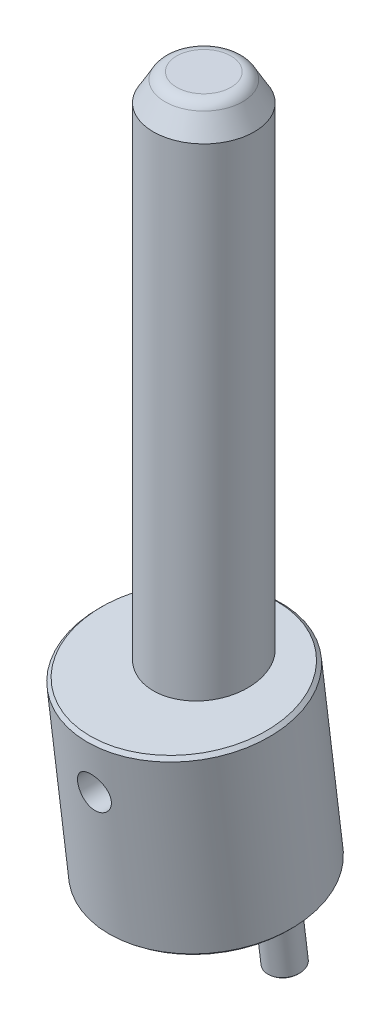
ISO-10303-21;
HEADER;
FILE_DESCRIPTION(('STEP AP214'),'2;1');
FILE_NAME('part.step','',(''),(''),'','','');
FILE_SCHEMA(('AUTOMOTIVE_DESIGN { 1 0 10303 214 1 1 1 1 }'));
ENDSEC;
DATA;
#1=APPLICATION_CONTEXT('core data for automotive mechanical design processes');
#2=APPLICATION_PROTOCOL_DEFINITION('international standard','automotive_design',2000,#1);
#3=PRODUCT_CONTEXT('',#1,'mechanical');
#4=PRODUCT('Part','Part','',(#3));
#5=PRODUCT_RELATED_PRODUCT_CATEGORY('part','',(#4));
#6=PRODUCT_DEFINITION_FORMATION('','',#4);
#7=PRODUCT_DEFINITION_CONTEXT('part definition',#1,'design');
#8=PRODUCT_DEFINITION('design','',#6,#7);
#9=PRODUCT_DEFINITION_SHAPE('','',#8);
#10=(LENGTH_UNIT() NAMED_UNIT(*) SI_UNIT(.MILLI.,.METRE.));
#11=(NAMED_UNIT(*) PLANE_ANGLE_UNIT() SI_UNIT($,.RADIAN.));
#12=(NAMED_UNIT(*) SI_UNIT($,.STERADIAN.) SOLID_ANGLE_UNIT());
#13=UNCERTAINTY_MEASURE_WITH_UNIT(LENGTH_MEASURE(1.E-05),#10,'distance_accuracy_value','');
#14=(GEOMETRIC_REPRESENTATION_CONTEXT(3) GLOBAL_UNCERTAINTY_ASSIGNED_CONTEXT((#13)) GLOBAL_UNIT_ASSIGNED_CONTEXT((#10,
#11,#12)) REPRESENTATION_CONTEXT('',''));
#15=CARTESIAN_POINT('',(0.,0.,0.));
#16=DIRECTION('',(0.,0.,1.));
#17=DIRECTION('',(1.,0.,0.));
#18=AXIS2_PLACEMENT_3D('',#15,#16,#17);
#19=CARTESIAN_POINT('',(0.,-25.2094466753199,-2.57557712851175));
#20=DIRECTION('',(0.,-0.992546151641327,-0.121869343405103));
#21=DIRECTION('',(0.,0.121869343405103,-0.992546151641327));
#22=AXIS2_PLACEMENT_3D('',#19,#20,#21);
#23=PLANE('',#22);
#24=CARTESIAN_POINT('',(-21.5,-25.2094466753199,-2.57557712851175));
#25=DIRECTION('',(0.,-0.992546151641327,-0.121869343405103));
#26=DIRECTION('',(0.,0.121869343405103,-0.992546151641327));
#27=AXIS2_PLACEMENT_3D('',#24,#25,#26);
#28=CIRCLE('',#27,4.50000075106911);
#29=CARTESIAN_POINT('',(-21.5,-24.6610345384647,-7.04203555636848));
#30=VERTEX_POINT('',#29);
#31=EDGE_CURVE('P0_E17',#30,#30,#28,.F.);
#32=ORIENTED_EDGE('',*,*,#31,.F.);
#33=EDGE_LOOP('',(#32));
#34=FACE_BOUND('',#33,.T.);
#35=ADVANCED_FACE('P0_F14',(#34),#23,.T.);
#36=CARTESIAN_POINT('',(0.,-25.2094466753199,-2.57557712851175));
#37=DIRECTION('',(0.,-0.992546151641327,-0.121869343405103));
#38=DIRECTION('',(0.,0.121869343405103,-0.992546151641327));
#39=AXIS2_PLACEMENT_3D('',#36,#37,#38);
#40=PLANE('',#39);
#41=CARTESIAN_POINT('',(21.5,-25.2094466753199,-2.57557712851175));
#42=DIRECTION('',(0.,-0.992546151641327,-0.121869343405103));
#43=DIRECTION('',(0.,0.121869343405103,-0.992546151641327));
#44=AXIS2_PLACEMENT_3D('',#41,#42,#43);
#45=CIRCLE('',#44,4.50000075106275);
#46=CARTESIAN_POINT('',(21.5,-24.6610345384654,-7.04203555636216));
#47=VERTEX_POINT('',#46);
#48=EDGE_CURVE('P0_E121',#47,#47,#45,.F.);
#49=ORIENTED_EDGE('',*,*,#48,.F.);
#50=EDGE_LOOP('',(#49));
#51=FACE_BOUND('',#50,.T.);
#52=ADVANCED_FACE('P0_F111',(#51),#40,.T.);
#53=CARTESIAN_POINT('',(0.,3.12944115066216E-12,-5.7744607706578E-13));
#54=DIRECTION('',(0.,-1.,0.));
#55=DIRECTION('',(0.,0.,-1.));
#56=AXIS2_PLACEMENT_3D('',#53,#54,#55);
#57=PLANE('',#56);
#58=CARTESIAN_POINT('',(0.,2.90045765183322E-12,-2.69847078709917E-12));
#59=DIRECTION('',(0.,-1.,0.));
#60=DIRECTION('',(0.,0.,-1.));
#61=AXIS2_PLACEMENT_3D('',#58,#59,#60);
#62=CIRCLE('',#61,15.);
#63=CARTESIAN_POINT('',(0.,2.90045765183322E-12,-15.0000000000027));
#64=VERTEX_POINT('',#63);
#65=EDGE_CURVE('P0_E36',#64,#64,#62,.F.);
#66=ORIENTED_EDGE('',*,*,#65,.T.);
#67=EDGE_LOOP('',(#66));
#68=FACE_BOUND('',#67,.T.);
#69=ADVANCED_FACE('P0_F108',(#68),#57,.F.);
#70=CARTESIAN_POINT('',(-21.5,-24.7131730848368,-2.51464239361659));
#71=DIRECTION('',(0.,0.992546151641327,0.121869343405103));
#72=DIRECTION('',(0.,-0.121869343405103,0.992546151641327));
#73=AXIS2_PLACEMENT_3D('',#70,#71,#72);
#74=CONICAL_SURFACE('',#73,5.00000135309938,0.785398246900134);
#75=CARTESIAN_POINT('',(-21.5,-24.7131717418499,-2.51464222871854));
#76=DIRECTION('',(0.,-0.992546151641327,-0.121869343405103));
#77=DIRECTION('',(0.,0.121869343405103,-0.992546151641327));
#78=AXIS2_PLACEMENT_3D('',#75,#76,#77);
#79=CIRCLE('',#78,5.);
#80=CARTESIAN_POINT('',(-21.5,-24.1038250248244,-7.47737298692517));
#81=VERTEX_POINT('',#80);
#82=EDGE_CURVE('P0_E33',#81,#81,#79,.F.);
#83=ORIENTED_EDGE('',*,*,#82,.F.);
#84=EDGE_LOOP('',(#83));
#85=FACE_BOUND('',#84,.T.);
#86=ORIENTED_EDGE('',*,*,#31,.T.);
#87=EDGE_LOOP('',(#86));
#88=FACE_BOUND('',#87,.T.);
#89=ADVANCED_FACE('P0_F104',(#85,#88),#74,.T.);
#90=CARTESIAN_POINT('',(21.5,-24.7131730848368,-2.51464239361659));
#91=DIRECTION('',(0.,0.992546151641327,0.121869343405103));
#92=DIRECTION('',(0.,-0.121869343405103,0.992546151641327));
#93=AXIS2_PLACEMENT_3D('',#90,#91,#92);
#94=CONICAL_SURFACE('',#93,5.00000135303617,0.785398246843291);
#95=CARTESIAN_POINT('',(21.5,-24.7131717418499,-2.51464222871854));
#96=DIRECTION('',(0.,-0.992546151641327,-0.121869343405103));
#97=DIRECTION('',(0.,0.121869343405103,-0.992546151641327));
#98=AXIS2_PLACEMENT_3D('',#95,#96,#97);
#99=CIRCLE('',#98,5.);
#100=CARTESIAN_POINT('',(21.5,-24.1038250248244,-7.47737298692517));
#101=VERTEX_POINT('',#100);
#102=EDGE_CURVE('P0_E29',#101,#101,#99,.F.);
#103=ORIENTED_EDGE('',*,*,#102,.F.);
#104=EDGE_LOOP('',(#103));
#105=FACE_BOUND('',#104,.T.);
#106=ORIENTED_EDGE('',*,*,#48,.T.);
#107=EDGE_LOOP('',(#106));
#108=FACE_BOUND('',#107,.T.);
#109=ADVANCED_FACE('P0_F99',(#105,#108),#94,.T.);
#110=CARTESIAN_POINT('',(0.,59.7458556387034,-2.69868762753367E-12));
#111=DIRECTION('',(0.,-1.,0.));
#112=DIRECTION('',(0.,0.,-1.));
#113=AXIS2_PLACEMENT_3D('',#110,#111,#112);
#114=CYLINDRICAL_SURFACE('',#113,15.);
#115=CARTESIAN_POINT('',(0.,45.0000000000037,-2.69955498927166E-12));
#116=DIRECTION('',(0.,0.992546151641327,0.121869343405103));
#117=DIRECTION('',(0.,-0.121869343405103,0.992546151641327));
#118=AXIS2_PLACEMENT_3D('',#115,#116,#117);
#119=ELLIPSE('',#118,15.1126473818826,15.);
#120=CARTESIAN_POINT('',(0.,43.1582315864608,14.9999999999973));
#121=VERTEX_POINT('',#120);
#122=EDGE_CURVE('P0_E32',#121,#121,#119,.F.);
#123=ORIENTED_EDGE('',*,*,#122,.F.);
#124=EDGE_LOOP('',(#123));
#125=FACE_BOUND('',#124,.T.);
#126=ORIENTED_EDGE('',*,*,#65,.F.);
#127=EDGE_LOOP('',(#126));
#128=FACE_BOUND('',#127,.T.);
#129=CARTESIAN_POINT('',(0.,31.0000000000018,14.9999999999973));
#130=CARTESIAN_POINT('',(-0.13627460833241,30.9999999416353,14.9999999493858));
#131=CARTESIAN_POINT('',(-0.27255067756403,30.9944241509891,14.9981386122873));
#132=CARTESIAN_POINT('',(-0.544142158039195,30.9721706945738,14.9907428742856));
#133=CARTESIAN_POINT('',(-0.679457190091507,30.9554888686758,14.9852070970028));
#134=CARTESIAN_POINT('',(-0.948257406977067,30.9111491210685,14.9706027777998));
#135=CARTESIAN_POINT('',(-1.08174007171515,30.8834773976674,14.9615297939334));
#136=CARTESIAN_POINT('',(-1.34580155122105,30.8174009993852,14.94009293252));
#137=CARTESIAN_POINT('',(-1.47637921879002,30.7789921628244,14.9277277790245));
#138=CARTESIAN_POINT('',(-1.7333461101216,30.6918928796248,14.9000723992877));
#139=CARTESIAN_POINT('',(-1.85974572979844,30.6432305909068,14.8847901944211));
#140=CARTESIAN_POINT('',(-2.10792399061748,30.5359631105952,14.8516789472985));
#141=CARTESIAN_POINT('',(-2.22970089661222,30.4773542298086,14.8338489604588));
#142=CARTESIAN_POINT('',(-2.58680471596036,30.2873070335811,14.7772227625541));
#143=CARTESIAN_POINT('',(-2.81420620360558,30.1415453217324,14.7352562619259));
#144=CARTESIAN_POINT('',(-3.24874257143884,29.8108587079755,14.6457020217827));
#145=CARTESIAN_POINT('',(-3.45501840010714,29.6248491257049,14.5979792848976));
#146=CARTESIAN_POINT('',(-3.8341436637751,29.2211801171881,14.5030192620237));
#147=CARTESIAN_POINT('',(-4.0069839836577,29.0035120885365,14.4557821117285));
#148=CARTESIAN_POINT('',(-4.31912807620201,28.5350726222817,14.3656662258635));
#149=CARTESIAN_POINT('',(-4.45732572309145,28.2835298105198,14.3229516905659));
#150=CARTESIAN_POINT('',(-4.68909399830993,27.7591186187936,14.248765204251));
#151=CARTESIAN_POINT('',(-4.78267844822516,27.4862568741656,14.2172897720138));
#152=CARTESIAN_POINT('',(-4.91936749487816,26.9366338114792,14.1705651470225));
#153=CARTESIAN_POINT('',(-4.96406724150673,26.6603139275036,14.1548047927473));
#154=CARTESIAN_POINT('',(-5.00670561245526,26.1036813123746,14.1397828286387));
#155=CARTESIAN_POINT('',(-5.00465868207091,25.8233698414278,14.1405161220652));
#156=CARTESIAN_POINT('',(-4.95509941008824,25.280317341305,14.1579507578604));
#157=CARTESIAN_POINT('',(-4.90966912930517,25.0173587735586,14.1739208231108));
#158=CARTESIAN_POINT('',(-4.77803186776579,24.5030345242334,14.2188326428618));
#159=CARTESIAN_POINT('',(-4.69181981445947,24.2516702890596,14.2477760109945));
#160=CARTESIAN_POINT('',(-4.47968995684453,23.7629279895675,14.3158968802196));
#161=CARTESIAN_POINT('',(-4.3531541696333,23.5258408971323,14.3552319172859));
#162=CARTESIAN_POINT('',(-4.06444611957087,23.0756402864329,14.4396288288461));
#163=CARTESIAN_POINT('',(-3.90226546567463,22.8625324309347,14.4846920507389));
#164=CARTESIAN_POINT('',(-3.53674216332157,22.4545530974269,14.5783642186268));
#165=CARTESIAN_POINT('',(-3.33169626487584,22.2612084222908,14.627035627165));
#166=CARTESIAN_POINT('',(-3.00176707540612,21.9988448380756,14.6970107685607));
#167=CARTESIAN_POINT('',(-2.88796886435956,21.9159467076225,14.7198467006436));
#168=CARTESIAN_POINT('',(-2.65358317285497,21.7599196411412,14.7638979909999));
#169=CARTESIAN_POINT('',(-2.53299841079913,21.6867868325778,14.7851139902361));
#170=CARTESIAN_POINT('',(-2.28442944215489,21.5500863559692,14.8255663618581));
#171=CARTESIAN_POINT('',(-2.15637801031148,21.4866337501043,14.8447781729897));
#172=CARTESIAN_POINT('',(-1.89503347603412,21.3708247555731,14.8803974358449));
#173=CARTESIAN_POINT('',(-1.76174256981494,21.3184637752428,14.8968060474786));
#174=CARTESIAN_POINT('',(-1.49104566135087,21.2253547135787,14.9263287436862));
#175=CARTESIAN_POINT('',(-1.3536464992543,21.1845884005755,14.939447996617));
#176=CARTESIAN_POINT('',(-1.0756272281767,21.1149668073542,14.9620340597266));
#177=CARTESIAN_POINT('',(-0.93500858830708,21.0861062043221,14.9715025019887));
#178=CARTESIAN_POINT('',(-0.662330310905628,21.0422867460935,14.9859443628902));
#179=CARTESIAN_POINT('',(-0.530427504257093,21.0264417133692,14.9912035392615));
#180=CARTESIAN_POINT('',(-0.265683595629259,21.0052983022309,14.9982313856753));
#181=CARTESIAN_POINT('',(-0.132842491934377,20.9999999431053,15.0000000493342));
#182=CARTESIAN_POINT('',(0.136274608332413,21.0000000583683,14.9999999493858));
#183=CARTESIAN_POINT('',(0.272550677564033,21.0055758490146,14.9981386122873));
#184=CARTESIAN_POINT('',(0.544142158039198,21.0278293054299,14.9907428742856));
#185=CARTESIAN_POINT('',(0.67945719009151,21.0445111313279,14.9852070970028));
#186=CARTESIAN_POINT('',(0.94825740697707,21.0888508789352,14.9706027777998));
#187=CARTESIAN_POINT('',(1.08174007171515,21.1165226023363,14.9615297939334));
#188=CARTESIAN_POINT('',(1.34580155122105,21.1825990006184,14.94009293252));
#189=CARTESIAN_POINT('',(1.47637921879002,21.2210078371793,14.9277277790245));
#190=CARTESIAN_POINT('',(1.7333461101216,21.3081071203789,14.9000723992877));
#191=CARTESIAN_POINT('',(1.85974572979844,21.3567694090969,14.8847901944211));
#192=CARTESIAN_POINT('',(2.10792399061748,21.4640368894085,14.8516789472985));
#193=CARTESIAN_POINT('',(2.22970089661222,21.5226457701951,14.8338489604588));
#194=CARTESIAN_POINT('',(2.58680471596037,21.7126929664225,14.7772227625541));
#195=CARTESIAN_POINT('',(2.81420620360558,21.8584546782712,14.7352562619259));
#196=CARTESIAN_POINT('',(3.24874257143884,22.1891412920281,14.6457020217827));
#197=CARTESIAN_POINT('',(3.45501840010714,22.3751508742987,14.5979792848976));
#198=CARTESIAN_POINT('',(3.8341436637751,22.7788198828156,14.5030192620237));
#199=CARTESIAN_POINT('',(4.0069839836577,22.9964879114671,14.4557821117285));
#200=CARTESIAN_POINT('',(4.31912807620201,23.464927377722,14.3656662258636));
#201=CARTESIAN_POINT('',(4.45732572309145,23.7164701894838,14.3229516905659));
#202=CARTESIAN_POINT('',(4.68909399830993,24.24088138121,14.248765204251));
#203=CARTESIAN_POINT('',(4.78267844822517,24.5137431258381,14.2172897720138));
#204=CARTESIAN_POINT('',(4.91936749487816,25.0633661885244,14.1705651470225));
#205=CARTESIAN_POINT('',(4.96406724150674,25.3396860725,14.1548047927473));
#206=CARTESIAN_POINT('',(5.00670561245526,25.896318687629,14.1397828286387));
#207=CARTESIAN_POINT('',(5.00465868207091,26.1766301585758,14.1405161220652));
#208=CARTESIAN_POINT('',(4.95509941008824,26.7196826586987,14.1579507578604));
#209=CARTESIAN_POINT('',(4.90966912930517,26.982641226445,14.1739208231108));
#210=CARTESIAN_POINT('',(4.77803186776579,27.4969654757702,14.2188326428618));
#211=CARTESIAN_POINT('',(4.69181981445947,27.748329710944,14.2477760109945));
#212=CARTESIAN_POINT('',(4.47968995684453,28.2370720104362,14.3158968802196));
#213=CARTESIAN_POINT('',(4.35315416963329,28.4741591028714,14.3552319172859));
#214=CARTESIAN_POINT('',(4.06444611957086,28.9243597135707,14.4396288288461));
#215=CARTESIAN_POINT('',(3.90226546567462,29.1374675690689,14.4846920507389));
#216=CARTESIAN_POINT('',(3.53674216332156,29.5454469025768,14.5783642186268));
#217=CARTESIAN_POINT('',(3.33169626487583,29.7387915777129,14.627035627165));
#218=CARTESIAN_POINT('',(3.00176707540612,30.0011551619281,14.6970107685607));
#219=CARTESIAN_POINT('',(2.88796886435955,30.0840532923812,14.7198467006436));
#220=CARTESIAN_POINT('',(2.65358317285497,30.2400803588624,14.7638979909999));
#221=CARTESIAN_POINT('',(2.53299841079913,30.3132131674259,14.7851139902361));
#222=CARTESIAN_POINT('',(2.28442944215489,30.4499136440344,14.8255663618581));
#223=CARTESIAN_POINT('',(2.15637801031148,30.5133662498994,14.8447781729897));
#224=CARTESIAN_POINT('',(1.89503347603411,30.6291752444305,14.8803974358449));
#225=CARTESIAN_POINT('',(1.76174256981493,30.6815362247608,14.8968060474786));
#226=CARTESIAN_POINT('',(1.49104566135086,30.7746452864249,14.9263287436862));
#227=CARTESIAN_POINT('',(1.3536464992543,30.8154115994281,14.939447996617));
#228=CARTESIAN_POINT('',(1.0756272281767,30.8850331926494,14.9620340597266));
#229=CARTESIAN_POINT('',(0.935008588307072,30.9138937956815,14.9715025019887));
#230=CARTESIAN_POINT('',(0.662330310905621,30.9577132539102,14.9859443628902));
#231=CARTESIAN_POINT('',(0.530427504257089,30.9735582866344,14.9912035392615));
#232=CARTESIAN_POINT('',(0.265683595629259,30.9947016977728,14.9982313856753));
#233=CARTESIAN_POINT('',(0.132842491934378,31.0000000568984,15.0000000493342));
#234=CARTESIAN_POINT('',(0.,31.0000000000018,14.9999999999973));
#235=B_SPLINE_CURVE_WITH_KNOTS('',3,(#129,#130,#131,#132,#133,#134,#135,#136,#137,#138,#139,
#140,#141,#142,#143,#144,#145,#146,#147,#148,#149,#150,#151,#152,#153,#154,#155,#156,#157,#158,
#159,#160,#161,#162,#163,#164,#165,#166,#167,#168,#169,#170,#171,#172,#173,#174,#175,#176,#177,
#178,#179,#180,#181,#182,#183,#184,#185,#186,#187,#188,#189,#190,#191,#192,#193,#194,#195,#196,
#197,#198,#199,#200,#201,#202,#203,#204,#205,#206,#207,#208,#209,#210,#211,#212,#213,#214,#215,
#216,#217,#218,#219,#220,#221,#222,#223,#224,#225,#226,#227,#228,#229,#230,#231,#232,#233,#234),
.UNSPECIFIED.,.T.,.F.,(4,2,2,2,2,2,2,2,2,2,2,2,2,2,2,2,2,2,2,2,2,2,2,2,2,2,2,2,2,2,2,2,2,2,2,2,
2,2,2,2,2,2,2,2,2,2,2,2,2,2,2,2,4),(0.,0.408700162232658,0.817553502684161,1.22692193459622,
1.6364492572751,2.04486626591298,2.45343508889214,3.26962321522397,4.11140352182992,
4.9534129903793,5.81961254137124,6.68554356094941,7.52228757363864,8.35877302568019,
9.15703078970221,9.95538786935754,10.7666215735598,11.5780464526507,12.4317109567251,
12.8591940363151,13.286507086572,13.7185586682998,14.150431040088,14.5816205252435,
15.0126170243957,15.4110232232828,15.8094301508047,16.2181303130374,16.6269836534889,
17.0363520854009,17.4458794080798,17.8542964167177,18.2628652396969,19.0790533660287,
19.9208336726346,20.762843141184,21.629042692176,22.4949737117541,23.3317177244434,
24.1682031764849,24.9664609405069,25.7648180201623,26.5760517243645,27.3874766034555,
28.2411411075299,28.6686241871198,29.0959372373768,29.5279888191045,29.9598611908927,
30.3910506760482,30.8220471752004,31.2204533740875,31.6188603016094),.UNSPECIFIED.);
#236=CARTESIAN_POINT('',(0.,31.0000000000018,14.9999999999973));
#237=VERTEX_POINT('',#236);
#238=EDGE_CURVE('P0_E84',#237,#237,#235,.T.);
#239=ORIENTED_EDGE('',*,*,#238,.T.);
#240=EDGE_LOOP('',(#239));
#241=FACE_BOUND('',#240,.T.);
#242=ADVANCED_FACE('P0_F93',(#125,#128,#241),#114,.F.);
#243=CARTESIAN_POINT('',(-21.5,-10.3212544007,-0.7475369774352));
#244=DIRECTION('',(0.,-0.992546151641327,-0.121869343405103));
#245=DIRECTION('',(0.,0.121869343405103,-0.992546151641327));
#246=AXIS2_PLACEMENT_3D('',#243,#244,#245);
#247=CYLINDRICAL_SURFACE('',#246,5.);
#248=CARTESIAN_POINT('',(-21.5,-10.3212544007,-0.7475369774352));
#249=DIRECTION('',(0.,-0.992546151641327,-0.121869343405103));
#250=DIRECTION('',(0.,0.121869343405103,-0.992546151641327));
#251=AXIS2_PLACEMENT_3D('',#248,#249,#250);
#252=CIRCLE('',#251,5.);
#253=CARTESIAN_POINT('',(-21.5,-9.71190768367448,-5.71026773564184));
#254=VERTEX_POINT('',#253);
#255=EDGE_CURVE('P0_E80',#254,#254,#252,.T.);
#256=ORIENTED_EDGE('',*,*,#255,.T.);
#257=EDGE_LOOP('',(#256));
#258=FACE_BOUND('',#257,.T.);
#259=ORIENTED_EDGE('',*,*,#82,.T.);
#260=EDGE_LOOP('',(#259));
#261=FACE_BOUND('',#260,.T.);
#262=ADVANCED_FACE('P0_F98',(#258,#261),#247,.T.);
#263=CARTESIAN_POINT('',(21.5,-10.3212544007,-0.7475369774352));
#264=DIRECTION('',(0.,-0.992546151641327,-0.121869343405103));
#265=DIRECTION('',(0.,0.121869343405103,-0.992546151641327));
#266=AXIS2_PLACEMENT_3D('',#263,#264,#265);
#267=CYLINDRICAL_SURFACE('',#266,5.);
#268=CARTESIAN_POINT('',(21.5,-10.3212544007,-0.7475369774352));
#269=DIRECTION('',(0.,-0.992546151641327,-0.121869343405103));
#270=DIRECTION('',(0.,0.121869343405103,-0.992546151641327));
#271=AXIS2_PLACEMENT_3D('',#268,#269,#270);
#272=CIRCLE('',#271,5.);
#273=CARTESIAN_POINT('',(21.5,-9.71190768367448,-5.71026773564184));
#274=VERTEX_POINT('',#273);
#275=EDGE_CURVE('P0_E76',#274,#274,#272,.T.);
#276=ORIENTED_EDGE('',*,*,#275,.T.);
#277=EDGE_LOOP('',(#276));
#278=FACE_BOUND('',#277,.T.);
#279=ORIENTED_EDGE('',*,*,#102,.T.);
#280=EDGE_LOOP('',(#279));
#281=FACE_BOUND('',#280,.T.);
#282=ADVANCED_FACE('P0_F178',(#278,#281),#267,.T.);
#283=CARTESIAN_POINT('',(0.,44.268783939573,5.95527690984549));
#284=DIRECTION('',(0.,0.992546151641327,0.121869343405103));
#285=DIRECTION('',(0.,-0.121869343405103,0.992546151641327));
#286=AXIS2_PLACEMENT_3D('',#283,#284,#285);
#287=PLANE('',#286);
#288=ORIENTED_EDGE('',*,*,#122,.T.);
#289=EDGE_LOOP('',(#288));
#290=FACE_BOUND('',#289,.T.);
#291=CARTESIAN_POINT('',(0.,44.268783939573,5.95527690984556));
#292=DIRECTION('',(0.,0.992546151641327,0.121869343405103));
#293=DIRECTION('',(0.,-0.121869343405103,0.992546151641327));
#294=AXIS2_PLACEMENT_3D('',#291,#292,#293);
#295=CIRCLE('',#294,27.9999945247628);
#296=CARTESIAN_POINT('',(0.,40.8564429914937,33.7465637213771));
#297=VERTEX_POINT('',#296);
#298=EDGE_CURVE('P0_E46',#297,#297,#295,.F.);
#299=ORIENTED_EDGE('',*,*,#298,.F.);
#300=EDGE_LOOP('',(#299));
#301=FACE_BOUND('',#300,.T.);
#302=ADVANCED_FACE('P0_F71',(#290,#301),#287,.T.);
#303=CARTESIAN_POINT('',(0.,26.0000000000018,-4.49837953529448));
#304=DIRECTION('',(0.,0.,1.));
#305=DIRECTION('',(0.,-1.,0.));
#306=AXIS2_PLACEMENT_3D('',#303,#304,#305);
#307=CYLINDRICAL_SURFACE('',#306,5.);
#308=ORIENTED_EDGE('',*,*,#238,.F.);
#309=EDGE_LOOP('',(#308));
#310=FACE_BOUND('',#309,.T.);
#311=CARTESIAN_POINT('',(0.,21.0000000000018,32.3160144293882));
#312=CARTESIAN_POINT('',(-0.1403461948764,21.0000006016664,32.3160142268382));
#313=CARTESIAN_POINT('',(-0.280708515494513,21.0059135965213,32.3157114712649));
#314=CARTESIAN_POINT('',(-0.560489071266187,21.0295298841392,32.3145230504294));
#315=CARTESIAN_POINT('',(-0.699906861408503,21.0472383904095,32.3136371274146));
#316=CARTESIAN_POINT('',(-0.976970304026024,21.094359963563,32.3113500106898));
#317=CARTESIAN_POINT('',(-1.11461288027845,21.1237911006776,32.3099480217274));
#318=CARTESIAN_POINT('',(-1.38697401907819,21.1941604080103,32.3067422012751));
#319=CARTESIAN_POINT('',(-1.52169146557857,21.2351028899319,32.3049382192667));
#320=CARTESIAN_POINT('',(-1.78703419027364,21.3281426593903,32.3010858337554));
#321=CARTESIAN_POINT('',(-1.91766413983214,21.3802266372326,32.2990377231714));
#322=CARTESIAN_POINT('',(-2.17412119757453,21.4952299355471,32.2948846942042));
#323=CARTESIAN_POINT('',(-2.29994651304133,21.5581532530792,32.2927797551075));
#324=CARTESIAN_POINT('',(-2.54575621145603,21.6943233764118,32.2887356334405));
#325=CARTESIAN_POINT('',(-2.66574505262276,21.7675621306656,32.2867963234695));
#326=CARTESIAN_POINT('',(-2.89917970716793,21.9239113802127,32.2833237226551));
#327=CARTESIAN_POINT('',(-3.01262309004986,22.0070255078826,32.2817905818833));
#328=CARTESIAN_POINT('',(-3.23214672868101,22.1825423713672,32.2793890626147));
#329=CARTESIAN_POINT('',(-3.33822469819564,22.2749479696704,32.2785208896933));
#330=CARTESIAN_POINT('',(-3.5422598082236,22.4684045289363,32.2777149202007));
#331=CARTESIAN_POINT('',(-3.64021392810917,22.5694586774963,32.2777774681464));
#332=CARTESIAN_POINT('',(-3.82722424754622,22.7794235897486,32.2790961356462));
#333=CARTESIAN_POINT('',(-3.91628336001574,22.8883317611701,32.2803518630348));
#334=CARTESIAN_POINT('',(-4.08493121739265,23.1132880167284,32.2843069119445));
#335=CARTESIAN_POINT('',(-4.16451648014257,23.2293387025,32.2870067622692));
#336=CARTESIAN_POINT('',(-4.31322552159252,23.4670878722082,32.2940602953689));
#337=CARTESIAN_POINT('',(-4.38240064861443,23.5887544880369,32.2984054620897));
#338=CARTESIAN_POINT('',(-4.51030821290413,23.8374364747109,32.3089450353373));
#339=CARTESIAN_POINT('',(-4.56903679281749,23.9644537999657,32.315140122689));
#340=CARTESIAN_POINT('',(-4.67558894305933,24.2228181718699,32.3295311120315));
#341=CARTESIAN_POINT('',(-4.72341729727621,24.3541632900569,32.337726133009));
#342=CARTESIAN_POINT('',(-4.80789683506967,24.6202704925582,32.3562192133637));
#343=CARTESIAN_POINT('',(-4.84454391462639,24.7550338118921,32.3665180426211));
#344=CARTESIAN_POINT('',(-4.93688227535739,25.1611177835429,32.4005185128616));
#345=CARTESIAN_POINT('',(-4.9757781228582,25.4362013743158,32.4274299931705));
#346=CARTESIAN_POINT('',(-5.00762672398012,25.9879273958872,32.4895650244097));
#347=CARTESIAN_POINT('',(-5.00057783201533,26.2645698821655,32.5247888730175));
#348=CARTESIAN_POINT('',(-4.94109053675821,26.81396350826,32.6026732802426));
#349=CARTESIAN_POINT('',(-4.88831502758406,27.086670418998,32.6453871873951));
#350=CARTESIAN_POINT('',(-4.7387120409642,27.6189440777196,32.7361104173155));
#351=CARTESIAN_POINT('',(-4.64187793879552,27.8785088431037,32.7841205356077));
#352=CARTESIAN_POINT('',(-4.46456377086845,28.2555797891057,32.8586334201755));
#353=CARTESIAN_POINT('',(-4.39916939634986,28.3805882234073,32.8841965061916));
#354=CARTESIAN_POINT('',(-4.25809696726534,28.6245830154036,32.9356111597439));
#355=CARTESIAN_POINT('',(-4.18242246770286,28.7435714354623,32.9614626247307));
#356=CARTESIAN_POINT('',(-4.02125558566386,28.9747907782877,33.0130529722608));
#357=CARTESIAN_POINT('',(-3.93575922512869,29.0870189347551,33.0387918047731));
#358=CARTESIAN_POINT('',(-3.75555564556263,29.3038867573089,33.0897102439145));
#359=CARTESIAN_POINT('',(-3.66085184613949,29.4085292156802,33.1148900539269));
#360=CARTESIAN_POINT('',(-3.46147534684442,29.6109051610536,33.1645984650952));
#361=CARTESIAN_POINT('',(-3.35668562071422,29.708526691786,33.1891137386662));
#362=CARTESIAN_POINT('',(-3.13896542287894,29.8945330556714,33.2366741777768));
#363=CARTESIAN_POINT('',(-3.02603811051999,29.98292144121,33.2597199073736));
#364=CARTESIAN_POINT('',(-2.79266578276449,30.149893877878,33.3039297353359));
#365=CARTESIAN_POINT('',(-2.672214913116,30.2284701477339,33.3250923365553));
#366=CARTESIAN_POINT('',(-2.42475245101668,30.3750711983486,33.3650874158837));
#367=CARTESIAN_POINT('',(-2.29774365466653,30.4431004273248,33.3839208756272));
#368=CARTESIAN_POINT('',(-2.04039417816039,30.5669254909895,33.4185615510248));
#369=CARTESIAN_POINT('',(-1.91015664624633,30.6229219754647,33.4344177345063));
#370=CARTESIAN_POINT('',(-1.6451638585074,30.7237189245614,33.4631901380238));
#371=CARTESIAN_POINT('',(-1.51041056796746,30.7685241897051,33.4761076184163));
#372=CARTESIAN_POINT('',(-1.23759367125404,30.8464886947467,33.4987168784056));
#373=CARTESIAN_POINT('',(-1.09953687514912,30.8796700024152,33.5084147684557));
#374=CARTESIAN_POINT('',(-0.82096944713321,30.9341801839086,33.5244053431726));
#375=CARTESIAN_POINT('',(-0.680460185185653,30.9555154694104,33.5306998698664));
#376=CARTESIAN_POINT('',(-0.449764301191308,30.9805445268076,33.5380965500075));
#377=CARTESIAN_POINT('',(-0.359985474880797,30.9878372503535,33.540255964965));
#378=CARTESIAN_POINT('',(-0.180141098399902,30.9975652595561,33.5431378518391));
#379=CARTESIAN_POINT('',(-0.0900755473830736,31.0000005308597,33.5438603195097));
#380=CARTESIAN_POINT('',(0.136709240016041,30.9999991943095,33.543859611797));
#381=CARTESIAN_POINT('',(0.273441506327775,30.9943875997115,33.5421943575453));
#382=CARTESIAN_POINT('',(0.545961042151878,30.9719848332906,33.5355649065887));
#383=CARTESIAN_POINT('',(0.681747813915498,30.9551881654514,33.5305990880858));
#384=CARTESIAN_POINT('',(0.951565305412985,30.9105245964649,33.5174577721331));
#385=CARTESIAN_POINT('',(1.0855927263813,30.8826393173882,33.5092769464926));
#386=CARTESIAN_POINT('',(1.35075378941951,30.8160315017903,33.4898669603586));
#387=CARTESIAN_POINT('',(1.48188628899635,30.7773047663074,33.4786366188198));
#388=CARTESIAN_POINT('',(1.73998721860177,30.6894545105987,33.4533812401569));
#389=CARTESIAN_POINT('',(1.86696488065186,30.6403561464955,33.4393629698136));
#390=CARTESIAN_POINT('',(2.11628565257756,30.5320871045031,33.4087775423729));
#391=CARTESIAN_POINT('',(2.23862702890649,30.4729127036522,33.3922094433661));
#392=CARTESIAN_POINT('',(2.47775385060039,30.3450094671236,33.356848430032));
#393=CARTESIAN_POINT('',(2.59454327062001,30.2762876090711,33.3380571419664));
#394=CARTESIAN_POINT('',(2.82197975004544,30.1297387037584,33.2985701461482));
#395=CARTESIAN_POINT('',(2.93262446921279,30.0519082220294,33.2778737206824));
#396=CARTESIAN_POINT('',(3.149501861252,29.8858337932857,33.2344511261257));
#397=CARTESIAN_POINT('',(3.25557746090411,29.7973936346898,33.2116895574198));
#398=CARTESIAN_POINT('',(3.4599293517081,29.6121926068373,33.1649502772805));
#399=CARTESIAN_POINT('',(3.55820275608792,29.5154286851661,33.1409721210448));
#400=CARTESIAN_POINT('',(3.84035615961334,29.2136228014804,33.0678255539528));
#401=CARTESIAN_POINT('',(4.01174082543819,28.996935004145,33.0174098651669));
#402=CARTESIAN_POINT('',(4.32137776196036,28.5311042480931,32.9149540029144));
#403=CARTESIAN_POINT('',(4.45839561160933,28.2811451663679,32.8629134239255));
#404=CARTESIAN_POINT('',(4.68824676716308,27.7609994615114,32.7620668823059));
#405=CARTESIAN_POINT('',(4.78107919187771,27.4908124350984,32.7132609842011));
#406=CARTESIAN_POINT('',(4.91969612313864,26.9371411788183,32.621588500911));
#407=CARTESIAN_POINT('',(4.96539505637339,26.6536337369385,32.5787328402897));
#408=CARTESIAN_POINT('',(5.00753076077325,26.0817237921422,32.5011046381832));
#409=CARTESIAN_POINT('',(5.0039747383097,25.793322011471,32.4663309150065));
#410=CARTESIAN_POINT('',(4.961795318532,25.3671635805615,32.4213989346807));
#411=CARTESIAN_POINT('',(4.94200263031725,25.2276707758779,32.4077374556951));
#412=CARTESIAN_POINT('',(4.8906765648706,24.9506761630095,32.3826233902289));
#413=CARTESIAN_POINT('',(4.85914786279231,24.8131735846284,32.3711699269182));
#414=CARTESIAN_POINT('',(4.78452071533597,24.5411400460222,32.3504459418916));
#415=CARTESIAN_POINT('',(4.74141861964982,24.406610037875,32.3411761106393));
#416=CARTESIAN_POINT('',(4.64395547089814,24.1416145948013,32.3247405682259));
#417=CARTESIAN_POINT('',(4.58959871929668,24.0111476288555,32.3175740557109));
#418=CARTESIAN_POINT('',(4.47093290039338,23.757213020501,32.3053015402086));
#419=CARTESIAN_POINT('',(4.40679287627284,23.6336677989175,32.3001650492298));
#420=CARTESIAN_POINT('',(4.26843362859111,23.3923554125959,32.2916228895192));
#421=CARTESIAN_POINT('',(4.19421821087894,23.2745860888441,32.2882165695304));
#422=CARTESIAN_POINT('',(4.03618732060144,23.0455877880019,32.2829236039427));
#423=CARTESIAN_POINT('',(3.95236899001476,22.934360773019,32.2810374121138));
#424=CARTESIAN_POINT('',(3.77577258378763,22.7193152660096,32.2785533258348));
#425=CARTESIAN_POINT('',(3.68299773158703,22.6154941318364,32.2779549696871));
#426=CARTESIAN_POINT('',(3.48889112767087,22.4157175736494,32.277795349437));
#427=CARTESIAN_POINT('',(3.38754011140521,22.3197808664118,32.2782364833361));
#428=CARTESIAN_POINT('',(3.17721816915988,22.1367485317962,32.2799019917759));
#429=CARTESIAN_POINT('',(3.06825001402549,22.0496497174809,32.2811260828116));
#430=CARTESIAN_POINT('',(2.84333243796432,21.8847943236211,32.2841021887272));
#431=CARTESIAN_POINT('',(2.7273773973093,21.8070454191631,32.2858546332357));
#432=CARTESIAN_POINT('',(2.48942071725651,21.6615410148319,32.2896401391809));
#433=CARTESIAN_POINT('',(2.36742127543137,21.5937819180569,32.2916730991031));
#434=CARTESIAN_POINT('',(2.11717785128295,21.4681885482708,32.2958093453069));
#435=CARTESIAN_POINT('',(1.98889130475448,21.4104390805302,32.2979130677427));
#436=CARTESIAN_POINT('',(1.72795524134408,21.3059704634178,32.3019676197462));
#437=CARTESIAN_POINT('',(1.59530735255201,21.2592472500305,32.3039185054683));
#438=CARTESIAN_POINT('',(1.3267530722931,21.1771988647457,32.3074920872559));
#439=CARTESIAN_POINT('',(1.19085200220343,21.1418562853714,32.3091152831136));
#440=CARTESIAN_POINT('',(0.916606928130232,21.0827349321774,32.3119018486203));
#441=CARTESIAN_POINT('',(0.778264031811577,21.0589510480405,32.3130654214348));
#442=CARTESIAN_POINT('',(0.533230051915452,21.0273666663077,32.314630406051));
#443=CARTESIAN_POINT('',(0.426849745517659,21.0171083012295,32.3151473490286));
#444=CARTESIAN_POINT('',(0.213649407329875,21.0034247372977,32.3158394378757));
#445=CARTESIAN_POINT('',(0.106829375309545,20.999999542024,32.3160145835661));
#446=CARTESIAN_POINT('',(0.,21.0000000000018,32.3160144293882));
#447=B_SPLINE_CURVE_WITH_KNOTS('',3,(#311,#312,#313,#314,#315,#316,#317,#318,#319,#320,#321,
#322,#323,#324,#325,#326,#327,#328,#329,#330,#331,#332,#333,#334,#335,#336,#337,#338,#339,#340,
#341,#342,#343,#344,#345,#346,#347,#348,#349,#350,#351,#352,#353,#354,#355,#356,#357,#358,#359,
#360,#361,#362,#363,#364,#365,#366,#367,#368,#369,#370,#371,#372,#373,#374,#375,#376,#377,#378,
#379,#380,#381,#382,#383,#384,#385,#386,#387,#388,#389,#390,#391,#392,#393,#394,#395,#396,#397,
#398,#399,#400,#401,#402,#403,#404,#405,#406,#407,#408,#409,#410,#411,#412,#413,#414,#415,#416,
#417,#418,#419,#420,#421,#422,#423,#424,#425,#426,#427,#428,#429,#430,#431,#432,#433,#434,#435,
#436,#437,#438,#439,#440,#441,#442,#443,#444,#445,#446),.UNSPECIFIED.,.T.,.F.,(4,2,2,2,2,2,2,2,
2,2,2,2,2,2,2,2,2,2,2,2,2,2,2,2,2,2,2,2,2,2,2,2,2,2,2,2,2,2,2,2,2,2,2,2,2,2,2,2,2,2,2,2,2,2,2,2,
2,2,2,2,2,2,2,2,2,2,2,4),(0.,0.42094192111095,0.84207001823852,1.26384980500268,
1.68578778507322,2.10722450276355,2.5288169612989,2.95008215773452,3.37150278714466,
3.79305364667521,4.21476055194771,4.63632890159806,5.05805172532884,5.47762093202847,
5.89734474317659,6.31688398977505,6.73657704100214,7.56965242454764,8.4027576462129,
9.24205745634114,10.0814835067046,10.5112052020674,10.9407786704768,11.3705267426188,
11.8001158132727,12.2354872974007,12.6706906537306,13.1062369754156,13.5415991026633,
13.9690137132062,14.3962446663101,14.8226600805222,15.2488444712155,15.5190143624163,
15.7891850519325,16.199227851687,16.6094722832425,17.0203994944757,17.431486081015,
17.8415868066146,18.2518393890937,18.6617937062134,19.0719031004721,19.4913178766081,
19.9108871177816,20.7493761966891,21.6146719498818,22.4799849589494,23.3468662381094,
24.2136206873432,24.637850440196,25.0619113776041,25.4861062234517,25.9101392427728,
26.327537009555,26.7447775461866,27.1621425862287,27.5793579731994,27.9975367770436,
28.4155642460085,28.833932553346,29.252149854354,29.6737535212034,30.0952015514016,
30.5160018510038,30.9366159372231,31.2570303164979,31.5774448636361),.UNSPECIFIED.);
#448=CARTESIAN_POINT('',(0.,21.0000000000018,32.3160144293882));
#449=VERTEX_POINT('',#448);
#450=EDGE_CURVE('P0_E39',#449,#449,#447,.T.);
#451=ORIENTED_EDGE('',*,*,#450,.F.);
#452=EDGE_LOOP('',(#451));
#453=FACE_BOUND('',#452,.T.);
#454=ADVANCED_FACE('P0_F48',(#310,#453),#307,.F.);
#455=CARTESIAN_POINT('',(0.,-10.3212544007,-0.7475369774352));
#456=DIRECTION('',(0.,0.992546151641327,0.121869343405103));
#457=DIRECTION('',(0.,-0.121869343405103,0.992546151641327));
#458=AXIS2_PLACEMENT_3D('',#455,#456,#457);
#459=PLANE('',#458);
#460=ORIENTED_EDGE('',*,*,#275,.F.);
#461=EDGE_LOOP('',(#460));
#462=FACE_BOUND('',#461,.T.);
#463=ORIENTED_EDGE('',*,*,#255,.F.);
#464=EDGE_LOOP('',(#463));
#465=FACE_BOUND('',#464,.T.);
#466=CARTESIAN_POINT('',(-1.28369537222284E-13,-10.3212544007,-0.74753697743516));
#467=DIRECTION('',(0.,0.992546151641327,0.121869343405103));
#468=DIRECTION('',(0.,-0.121869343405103,0.992546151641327));
#469=AXIS2_PLACEMENT_3D('',#466,#467,#468);
#470=CIRCLE('',#469,27.9999942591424);
#471=CARTESIAN_POINT('',(-1.28369537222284E-13,-13.7335953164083,27.0437495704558));
#472=VERTEX_POINT('',#471);
#473=EDGE_CURVE('P0_E26',#472,#472,#470,.T.);
#474=ORIENTED_EDGE('',*,*,#473,.F.);
#475=EDGE_LOOP('',(#474));
#476=FACE_BOUND('',#475,.T.);
#477=ADVANCED_FACE('P0_F63',(#462,#465,#476),#459,.F.);
#478=CARTESIAN_POINT('',(0.,43.2762348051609,5.83340720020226));
#479=DIRECTION('',(0.,-0.992546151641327,-0.121869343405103));
#480=DIRECTION('',(0.,0.121869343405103,-0.992546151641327));
#481=AXIS2_PLACEMENT_3D('',#478,#479,#480);
#482=CONICAL_SURFACE('',#481,28.9999973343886,0.785398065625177);
#483=ORIENTED_EDGE('',*,*,#298,.T.);
#484=EDGE_LOOP('',(#483));
#485=FACE_BOUND('',#484,.T.);
#486=CARTESIAN_POINT('',(0.,43.2762374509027,5.83340752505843));
#487=DIRECTION('',(0.,0.992546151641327,0.121869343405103));
#488=DIRECTION('',(0.,-0.121869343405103,0.992546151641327));
#489=AXIS2_PLACEMENT_3D('',#486,#487,#488);
#490=CIRCLE('',#489,29.);
#491=CARTESIAN_POINT('',(0.,39.7420264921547,34.6172459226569));
#492=VERTEX_POINT('',#491);
#493=EDGE_CURVE('P0_E21',#492,#492,#490,.F.);
#494=ORIENTED_EDGE('',*,*,#493,.F.);
#495=EDGE_LOOP('',(#494));
#496=FACE_BOUND('',#495,.T.);
#497=ADVANCED_FACE('P0_F60',(#485,#496),#482,.T.);
#498=CARTESIAN_POINT('',(-1.28369537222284E-13,-9.32870509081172,-0.625667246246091));
#499=DIRECTION('',(0.,0.992546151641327,0.121869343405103));
#500=DIRECTION('',(0.,-0.121869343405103,0.992546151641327));
#501=AXIS2_PLACEMENT_3D('',#498,#499,#500);
#502=CONICAL_SURFACE('',#501,28.9999972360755,0.785398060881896);
#503=CARTESIAN_POINT('',(0.,-9.32870783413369,-0.625667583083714));
#504=DIRECTION('',(0.,0.992546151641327,0.121869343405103));
#505=DIRECTION('',(0.,-0.121869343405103,0.992546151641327));
#506=AXIS2_PLACEMENT_3D('',#503,#504,#505);
#507=CIRCLE('',#506,29.);
#508=CARTESIAN_POINT('',(0.,-12.8629187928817,28.1581708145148));
#509=VERTEX_POINT('',#508);
#510=EDGE_CURVE('P0_E9',#509,#509,#507,.T.);
#511=ORIENTED_EDGE('',*,*,#510,.F.);
#512=EDGE_LOOP('',(#511));
#513=FACE_BOUND('',#512,.T.);
#514=ORIENTED_EDGE('',*,*,#473,.T.);
#515=EDGE_LOOP('',(#514));
#516=FACE_BOUND('',#515,.T.);
#517=ADVANCED_FACE('P0_F56',(#513,#516),#502,.T.);
#518=CARTESIAN_POINT('',(0.,-13.0507563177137,-1.08267767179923));
#519=DIRECTION('',(0.,0.992546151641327,0.121869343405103));
#520=DIRECTION('',(0.,-0.121869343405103,0.992546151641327));
#521=AXIS2_PLACEMENT_3D('',#518,#519,#520);
#522=CYLINDRICAL_SURFACE('',#521,29.);
#523=ORIENTED_EDGE('',*,*,#493,.T.);
#524=EDGE_LOOP('',(#523));
#525=FACE_BOUND('',#524,.T.);
#526=ORIENTED_EDGE('',*,*,#510,.T.);
#527=EDGE_LOOP('',(#526));
#528=FACE_BOUND('',#527,.T.);
#529=ORIENTED_EDGE('',*,*,#450,.T.);
#530=EDGE_LOOP('',(#529));
#531=FACE_BOUND('',#530,.T.);
#532=ADVANCED_FACE('P0_F52',(#525,#528,#531),#522,.T.);
#533=CLOSED_SHELL('',(#35,#52,#69,#89,#109,#242,#262,#282,#302,#454,#477,#497,#517,#532));
#534=MANIFOLD_SOLID_BREP('P0_B1',#533);
#535=CARTESIAN_POINT('',(0.,195.,0.));
#536=DIRECTION('',(0.,1.,0.));
#537=DIRECTION('',(-1.,0.,0.));
#538=AXIS2_PLACEMENT_3D('',#535,#536,#537);
#539=PLANE('',#538);
#540=CARTESIAN_POINT('',(0.,195.,0.));
#541=DIRECTION('',(0.,-1.,0.));
#542=DIRECTION('',(0.,0.,-1.));
#543=AXIS2_PLACEMENT_3D('',#540,#541,#542);
#544=CIRCLE('',#543,8.071796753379);
#545=CARTESIAN_POINT('',(0.,195.,-8.0717967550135));
#546=VERTEX_POINT('',#545);
#547=CARTESIAN_POINT('',(0.,195.,8.0717967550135));
#548=VERTEX_POINT('',#547);
#549=EDGE_CURVE('P1_E38',#546,#548,#544,.T.);
#550=ORIENTED_EDGE('',*,*,#549,.F.);
#551=CARTESIAN_POINT('',(0.,195.,0.));
#552=DIRECTION('',(0.,-1.,0.));
#553=DIRECTION('',(0.,0.,1.));
#554=AXIS2_PLACEMENT_3D('',#551,#552,#553);
#555=CIRCLE('',#554,8.071796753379);
#556=EDGE_CURVE('P1_E42',#548,#546,#555,.T.);
#557=ORIENTED_EDGE('',*,*,#556,.F.);
#558=EDGE_LOOP('',(#550,#557));
#559=FACE_BOUND('',#558,.T.);
#560=ADVANCED_FACE('P1_F17',(#559),#539,.T.);
#561=CARTESIAN_POINT('',(0.,191.,0.));
#562=DIRECTION('',(0.,1.,0.));
#563=DIRECTION('',(0.0058252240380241,0.,0.999983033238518));
#564=AXIS2_PLACEMENT_3D('',#561,#562,#563);
#565=TOROIDAL_SURFACE('',#564,8.071796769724,4.);
#566=ORIENTED_EDGE('',*,*,#549,.T.);
#567=ORIENTED_EDGE('',*,*,#556,.T.);
#568=EDGE_LOOP('',(#566,#567));
#569=FACE_BOUND('',#568,.T.);
#570=CARTESIAN_POINT('',(0.,193.000000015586,0.));
#571=DIRECTION('',(0.,-1.,0.));
#572=DIRECTION('',(0.,0.,1.));
#573=AXIS2_PLACEMENT_3D('',#570,#571,#572);
#574=CIRCLE('',#573,11.5358983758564);
#575=CARTESIAN_POINT('',(0.,193.000000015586,11.5358983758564));
#576=VERTEX_POINT('',#575);
#577=EDGE_CURVE('P1_E48',#576,#576,#574,.T.);
#578=ORIENTED_EDGE('',*,*,#577,.F.);
#579=EDGE_LOOP('',(#578));
#580=FACE_BOUND('',#579,.T.);
#581=ADVANCED_FACE('P1_F40',(#569,#580),#565,.T.);
#582=CARTESIAN_POINT('',(0.,0.,0.));
#583=DIRECTION('',(0.,1.,0.));
#584=DIRECTION('',(-1.,0.,0.));
#585=AXIS2_PLACEMENT_3D('',#582,#583,#584);
#586=PLANE('',#585);
#587=CARTESIAN_POINT('',(0.,0.,0.));
#588=DIRECTION('',(0.,1.,0.));
#589=DIRECTION('',(-1.,0.,0.));
#590=AXIS2_PLACEMENT_3D('',#587,#588,#589);
#591=CIRCLE('',#590,13.999996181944);
#592=CARTESIAN_POINT('',(-13.999996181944,0.,0.));
#593=VERTEX_POINT('',#592);
#594=EDGE_CURVE('P1_E85',#593,#593,#591,.T.);
#595=ORIENTED_EDGE('',*,*,#594,.F.);
#596=EDGE_LOOP('',(#595));
#597=FACE_BOUND('',#596,.T.);
#598=ADVANCED_FACE('P1_F76',(#597),#586,.F.);
#599=CARTESIAN_POINT('',(0.,26.,4.88675134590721));
#600=DIRECTION('',(0.,0.,1.));
#601=DIRECTION('',(0.,-1.,0.));
#602=AXIS2_PLACEMENT_3D('',#599,#600,#601);
#603=CONICAL_SURFACE('',#602,4.99999999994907,1.04719755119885);
#604=CARTESIAN_POINT('',(0.,26.0000000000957,1.99999999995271));
#605=VERTEX_POINT('',#604);
#606=VERTEX_LOOP('',#605);
#607=FACE_BOUND('',#606,.T.);
#608=CARTESIAN_POINT('',(0.,26.,4.886751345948));
#609=DIRECTION('',(0.,0.,1.));
#610=DIRECTION('',(0.,-1.,0.));
#611=AXIS2_PLACEMENT_3D('',#608,#609,#610);
#612=CIRCLE('',#611,5.);
#613=CARTESIAN_POINT('',(0.,21.,4.886751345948));
#614=VERTEX_POINT('',#613);
#615=EDGE_CURVE('P1_E82',#614,#614,#612,.T.);
#616=ORIENTED_EDGE('',*,*,#615,.T.);
#617=EDGE_LOOP('',(#616));
#618=FACE_BOUND('',#617,.T.);
#619=ADVANCED_FACE('P1_F116',(#607,#618),#603,.F.);
#620=CARTESIAN_POINT('',(0.,186.999999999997,0.));
#621=DIRECTION('',(0.,-1.,0.));
#622=DIRECTION('',(1.,0.,0.));
#623=AXIS2_PLACEMENT_3D('',#620,#621,#622);
#624=CONICAL_SURFACE('',#623,14.9999999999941,0.5235987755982);
#625=CARTESIAN_POINT('',(0.,187.,0.));
#626=DIRECTION('',(0.,1.,0.));
#627=DIRECTION('',(-1.,0.,0.));
#628=AXIS2_PLACEMENT_3D('',#625,#626,#627);
#629=CIRCLE('',#628,15.);
#630=CARTESIAN_POINT('',(-15.,187.,0.));
#631=VERTEX_POINT('',#630);
#632=EDGE_CURVE('P1_E92',#631,#631,#629,.F.);
#633=ORIENTED_EDGE('',*,*,#632,.F.);
#634=EDGE_LOOP('',(#633));
#635=FACE_BOUND('',#634,.T.);
#636=ORIENTED_EDGE('',*,*,#577,.T.);
#637=EDGE_LOOP('',(#636));
#638=FACE_BOUND('',#637,.T.);
#639=ADVANCED_FACE('P1_F108',(#635,#638),#624,.T.);
#640=CARTESIAN_POINT('',(0.,1.00000219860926,0.));
#641=DIRECTION('',(0.,1.,0.));
#642=DIRECTION('',(-1.,0.,0.));
#643=AXIS2_PLACEMENT_3D('',#640,#641,#642);
#644=CONICAL_SURFACE('',#643,14.9999981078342,0.785398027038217);
#645=CARTESIAN_POINT('',(0.,1.000000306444,0.));
#646=DIRECTION('',(0.,1.,0.));
#647=DIRECTION('',(-1.,0.,0.));
#648=AXIS2_PLACEMENT_3D('',#645,#646,#647);
#649=CIRCLE('',#648,15.);
#650=CARTESIAN_POINT('',(-15.,1.000000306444,0.));
#651=VERTEX_POINT('',#650);
#652=EDGE_CURVE('P1_E28',#651,#651,#649,.T.);
#653=ORIENTED_EDGE('',*,*,#652,.F.);
#654=EDGE_LOOP('',(#653));
#655=FACE_BOUND('',#654,.T.);
#656=ORIENTED_EDGE('',*,*,#594,.T.);
#657=EDGE_LOOP('',(#656));
#658=FACE_BOUND('',#657,.T.);
#659=ADVANCED_FACE('P1_F105',(#655,#658),#644,.T.);
#660=CARTESIAN_POINT('',(0.,26.,1.25));
#661=DIRECTION('',(0.,0.,1.));
#662=DIRECTION('',(0.,-1.,0.));
#663=AXIS2_PLACEMENT_3D('',#660,#661,#662);
#664=CYLINDRICAL_SURFACE('',#663,5.);
#665=ORIENTED_EDGE('',*,*,#615,.F.);
#666=EDGE_LOOP('',(#665));
#667=FACE_BOUND('',#666,.T.);
#668=CARTESIAN_POINT('',(0.,21.,15.));
#669=CARTESIAN_POINT('',(-0.136274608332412,21.0000000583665,14.9999999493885));
#670=CARTESIAN_POINT('',(-0.272550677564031,21.0055758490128,14.99813861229));
#671=CARTESIAN_POINT('',(-0.544142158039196,21.0278293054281,14.9907428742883));
#672=CARTESIAN_POINT('',(-0.679457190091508,21.044511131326,14.9852070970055));
#673=CARTESIAN_POINT('',(-0.948257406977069,21.0888508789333,14.9706027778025));
#674=CARTESIAN_POINT('',(-1.08174007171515,21.1165226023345,14.9615297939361));
#675=CARTESIAN_POINT('',(-1.34580155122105,21.1825990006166,14.9400929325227));
#676=CARTESIAN_POINT('',(-1.47637921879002,21.2210078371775,14.9277277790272));
#677=CARTESIAN_POINT('',(-1.7333461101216,21.308107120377,14.9000723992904));
#678=CARTESIAN_POINT('',(-1.85974572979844,21.356769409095,14.8847901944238));
#679=CARTESIAN_POINT('',(-2.10792399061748,21.4640368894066,14.8516789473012));
#680=CARTESIAN_POINT('',(-2.22970089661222,21.5226457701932,14.8338489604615));
#681=CARTESIAN_POINT('',(-2.58680471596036,21.7126929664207,14.7772227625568));
#682=CARTESIAN_POINT('',(-2.81420620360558,21.8584546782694,14.7352562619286));
#683=CARTESIAN_POINT('',(-3.24874257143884,22.1891412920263,14.6457020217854));
#684=CARTESIAN_POINT('',(-3.45501840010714,22.3751508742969,14.5979792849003));
#685=CARTESIAN_POINT('',(-3.8341436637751,22.7788198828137,14.5030192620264));
#686=CARTESIAN_POINT('',(-4.0069839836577,22.9964879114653,14.4557821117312));
#687=CARTESIAN_POINT('',(-4.31912807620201,23.4649273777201,14.3656662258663));
#688=CARTESIAN_POINT('',(-4.45732572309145,23.716470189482,14.3229516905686));
#689=CARTESIAN_POINT('',(-4.68909399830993,24.2408813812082,14.2487652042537));
#690=CARTESIAN_POINT('',(-4.78267844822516,24.5137431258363,14.2172897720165));
#691=CARTESIAN_POINT('',(-4.91936749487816,25.0633661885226,14.1705651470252));
#692=CARTESIAN_POINT('',(-4.96406724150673,25.3396860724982,14.15480479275));
#693=CARTESIAN_POINT('',(-5.00670561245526,25.8963186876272,14.1397828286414));
#694=CARTESIAN_POINT('',(-5.00465868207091,26.176630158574,14.1405161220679));
#695=CARTESIAN_POINT('',(-4.95509941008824,26.7196826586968,14.1579507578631));
#696=CARTESIAN_POINT('',(-4.90966912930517,26.9826412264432,14.1739208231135));
#697=CARTESIAN_POINT('',(-4.77803186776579,27.4969654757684,14.2188326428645));
#698=CARTESIAN_POINT('',(-4.69181981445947,27.7483297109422,14.2477760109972));
#699=CARTESIAN_POINT('',(-4.47968995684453,28.2370720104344,14.3158968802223));
#700=CARTESIAN_POINT('',(-4.3531541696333,28.4741591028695,14.3552319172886));
#701=CARTESIAN_POINT('',(-4.06444611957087,28.9243597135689,14.4396288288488));
#702=CARTESIAN_POINT('',(-3.90226546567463,29.1374675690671,14.4846920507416));
#703=CARTESIAN_POINT('',(-3.53674216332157,29.5454469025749,14.5783642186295));
#704=CARTESIAN_POINT('',(-3.33169626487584,29.7387915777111,14.6270356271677));
#705=CARTESIAN_POINT('',(-3.00176707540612,30.0011551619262,14.6970107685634));
#706=CARTESIAN_POINT('',(-2.88796886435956,30.0840532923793,14.7198467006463));
#707=CARTESIAN_POINT('',(-2.65358317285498,30.2400803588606,14.7638979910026));
#708=CARTESIAN_POINT('',(-2.53299841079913,30.3132131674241,14.7851139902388));
#709=CARTESIAN_POINT('',(-2.28442944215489,30.4499136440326,14.8255663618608));
#710=CARTESIAN_POINT('',(-2.15637801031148,30.5133662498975,14.8447781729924));
#711=CARTESIAN_POINT('',(-1.89503347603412,30.6291752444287,14.8803974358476));
#712=CARTESIAN_POINT('',(-1.76174256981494,30.681536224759,14.8968060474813));
#713=CARTESIAN_POINT('',(-1.49104566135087,30.7746452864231,14.9263287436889));
#714=CARTESIAN_POINT('',(-1.3536464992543,30.8154115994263,14.9394479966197));
#715=CARTESIAN_POINT('',(-1.0756272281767,30.8850331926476,14.9620340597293));
#716=CARTESIAN_POINT('',(-0.935008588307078,30.9138937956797,14.9715025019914));
#717=CARTESIAN_POINT('',(-0.662330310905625,30.9577132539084,14.9859443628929));
#718=CARTESIAN_POINT('',(-0.530427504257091,30.9735582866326,14.9912035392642));
#719=CARTESIAN_POINT('',(-0.265683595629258,30.994701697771,14.998231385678));
#720=CARTESIAN_POINT('',(-0.132842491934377,31.0000000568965,15.0000000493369));
#721=CARTESIAN_POINT('',(0.13627460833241,30.9999999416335,14.9999999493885));
#722=CARTESIAN_POINT('',(0.272550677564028,30.9944241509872,14.99813861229));
#723=CARTESIAN_POINT('',(0.544142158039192,30.9721706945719,14.9907428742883));
#724=CARTESIAN_POINT('',(0.679457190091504,30.955488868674,14.9852070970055));
#725=CARTESIAN_POINT('',(0.948257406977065,30.9111491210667,14.9706027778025));
#726=CARTESIAN_POINT('',(1.08174007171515,30.8834773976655,14.9615297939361));
#727=CARTESIAN_POINT('',(1.34580155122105,30.8174009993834,14.9400929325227));
#728=CARTESIAN_POINT('',(1.47637921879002,30.7789921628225,14.9277277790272));
#729=CARTESIAN_POINT('',(1.7333461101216,30.691892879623,14.9000723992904));
#730=CARTESIAN_POINT('',(1.85974572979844,30.643230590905,14.8847901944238));
#731=CARTESIAN_POINT('',(2.10792399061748,30.5359631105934,14.8516789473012));
#732=CARTESIAN_POINT('',(2.22970089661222,30.4773542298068,14.8338489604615));
#733=CARTESIAN_POINT('',(2.58680471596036,30.2873070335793,14.7772227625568));
#734=CARTESIAN_POINT('',(2.81420620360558,30.1415453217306,14.7352562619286));
#735=CARTESIAN_POINT('',(3.24874257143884,29.8108587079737,14.6457020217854));
#736=CARTESIAN_POINT('',(3.45501840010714,29.6248491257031,14.5979792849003));
#737=CARTESIAN_POINT('',(3.8341436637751,29.2211801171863,14.5030192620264));
#738=CARTESIAN_POINT('',(4.0069839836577,29.0035120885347,14.4557821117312));
#739=CARTESIAN_POINT('',(4.31912807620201,28.5350726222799,14.3656662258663));
#740=CARTESIAN_POINT('',(4.45732572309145,28.283529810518,14.3229516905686));
#741=CARTESIAN_POINT('',(4.68909399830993,27.7591186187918,14.2487652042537));
#742=CARTESIAN_POINT('',(4.78267844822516,27.4862568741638,14.2172897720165));
#743=CARTESIAN_POINT('',(4.91936749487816,26.9366338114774,14.1705651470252));
#744=CARTESIAN_POINT('',(4.96406724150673,26.6603139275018,14.15480479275));
#745=CARTESIAN_POINT('',(5.00670561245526,26.1036813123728,14.1397828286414));
#746=CARTESIAN_POINT('',(5.00465868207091,25.823369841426,14.1405161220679));
#747=CARTESIAN_POINT('',(4.95509941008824,25.2803173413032,14.1579507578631));
#748=CARTESIAN_POINT('',(4.90966912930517,25.0173587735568,14.1739208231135));
#749=CARTESIAN_POINT('',(4.77803186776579,24.5030345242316,14.2188326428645));
#750=CARTESIAN_POINT('',(4.69181981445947,24.2516702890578,14.2477760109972));
#751=CARTESIAN_POINT('',(4.47968995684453,23.7629279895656,14.3158968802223));
#752=CARTESIAN_POINT('',(4.35315416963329,23.5258408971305,14.3552319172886));
#753=CARTESIAN_POINT('',(4.06444611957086,23.0756402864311,14.4396288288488));
#754=CARTESIAN_POINT('',(3.90226546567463,22.8625324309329,14.4846920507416));
#755=CARTESIAN_POINT('',(3.53674216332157,22.4545530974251,14.5783642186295));
#756=CARTESIAN_POINT('',(3.33169626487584,22.2612084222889,14.6270356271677));
#757=CARTESIAN_POINT('',(3.00176707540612,21.9988448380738,14.6970107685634));
#758=CARTESIAN_POINT('',(2.88796886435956,21.9159467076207,14.7198467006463));
#759=CARTESIAN_POINT('',(2.65358317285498,21.7599196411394,14.7638979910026));
#760=CARTESIAN_POINT('',(2.53299841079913,21.6867868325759,14.7851139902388));
#761=CARTESIAN_POINT('',(2.28442944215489,21.5500863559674,14.8255663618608));
#762=CARTESIAN_POINT('',(2.15637801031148,21.4866337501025,14.8447781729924));
#763=CARTESIAN_POINT('',(1.89503347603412,21.3708247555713,14.8803974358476));
#764=CARTESIAN_POINT('',(1.76174256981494,21.318463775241,14.8968060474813));
#765=CARTESIAN_POINT('',(1.49104566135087,21.2253547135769,14.9263287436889));
#766=CARTESIAN_POINT('',(1.3536464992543,21.1845884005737,14.9394479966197));
#767=CARTESIAN_POINT('',(1.07562722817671,21.1149668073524,14.9620340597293));
#768=CARTESIAN_POINT('',(0.935008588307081,21.0861062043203,14.9715025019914));
#769=CARTESIAN_POINT('',(0.662330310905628,21.0422867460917,14.9859443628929));
#770=CARTESIAN_POINT('',(0.530427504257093,21.0264417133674,14.9912035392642));
#771=CARTESIAN_POINT('',(0.265683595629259,21.005298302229,14.998231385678));
#772=CARTESIAN_POINT('',(0.132842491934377,20.9999999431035,15.0000000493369));
#773=CARTESIAN_POINT('',(0.,21.,15.));
#774=B_SPLINE_CURVE_WITH_KNOTS('',3,(#668,#669,#670,#671,#672,#673,#674,#675,#676,#677,#678,
#679,#680,#681,#682,#683,#684,#685,#686,#687,#688,#689,#690,#691,#692,#693,#694,#695,#696,#697,
#698,#699,#700,#701,#702,#703,#704,#705,#706,#707,#708,#709,#710,#711,#712,#713,#714,#715,#716,
#717,#718,#719,#720,#721,#722,#723,#724,#725,#726,#727,#728,#729,#730,#731,#732,#733,#734,#735,
#736,#737,#738,#739,#740,#741,#742,#743,#744,#745,#746,#747,#748,#749,#750,#751,#752,#753,#754,
#755,#756,#757,#758,#759,#760,#761,#762,#763,#764,#765,#766,#767,#768,#769,#770,#771,#772,#773),
.UNSPECIFIED.,.T.,.F.,(4,2,2,2,2,2,2,2,2,2,2,2,2,2,2,2,2,2,2,2,2,2,2,2,2,2,2,2,2,2,2,2,2,2,2,2,
2,2,2,2,2,2,2,2,2,2,2,2,2,2,2,2,4),(0.,0.408700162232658,0.817553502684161,1.22692193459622,
1.6364492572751,2.04486626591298,2.45343508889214,3.26962321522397,4.11140352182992,
4.9534129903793,5.81961254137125,6.68554356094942,7.52228757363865,8.3587730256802,
9.15703078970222,9.95538786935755,10.7666215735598,11.5780464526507,12.4317109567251,
12.8591940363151,13.286507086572,13.7185586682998,14.150431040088,14.5816205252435,
15.0126170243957,15.4110232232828,15.8094301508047,16.2181303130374,16.6269836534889,
17.0363520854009,17.4458794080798,17.8542964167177,18.2628652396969,19.0790533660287,
19.9208336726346,20.762843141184,21.629042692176,22.4949737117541,23.3317177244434,
24.1682031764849,24.9664609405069,25.7648180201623,26.5760517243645,27.3874766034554,
28.2411411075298,28.6686241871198,29.0959372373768,29.5279888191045,29.9598611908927,
30.3910506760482,30.8220471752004,31.2204533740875,31.6188603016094),.UNSPECIFIED.);
#775=CARTESIAN_POINT('',(0.,21.,15.));
#776=VERTEX_POINT('',#775);
#777=EDGE_CURVE('P1_E11',#776,#776,#774,.T.);
#778=ORIENTED_EDGE('',*,*,#777,.F.);
#779=EDGE_LOOP('',(#778));
#780=FACE_BOUND('',#779,.T.);
#781=ADVANCED_FACE('P1_F107',(#667,#780),#664,.F.);
#782=CARTESIAN_POINT('',(0.,-9.75,0.));
#783=DIRECTION('',(0.,1.,0.));
#784=DIRECTION('',(-1.,0.,0.));
#785=AXIS2_PLACEMENT_3D('',#782,#783,#784);
#786=CYLINDRICAL_SURFACE('',#785,15.);
#787=ORIENTED_EDGE('',*,*,#632,.T.);
#788=EDGE_LOOP('',(#787));
#789=FACE_BOUND('',#788,.T.);
#790=ORIENTED_EDGE('',*,*,#652,.T.);
#791=EDGE_LOOP('',(#790));
#792=FACE_BOUND('',#791,.T.);
#793=ORIENTED_EDGE('',*,*,#777,.T.);
#794=EDGE_LOOP('',(#793));
#795=FACE_BOUND('',#794,.T.);
#796=ADVANCED_FACE('P1_F102',(#789,#792,#795),#786,.T.);
#797=CLOSED_SHELL('',(#560,#581,#598,#619,#639,#659,#781,#796));
#798=MANIFOLD_SOLID_BREP('P1_B1',#797);
#799=ADVANCED_BREP_SHAPE_REPRESENTATION('',(#18,#534,#798),#14);
#800=SHAPE_DEFINITION_REPRESENTATION(#9,#799);
ENDSEC;
END-ISO-10303-21;
